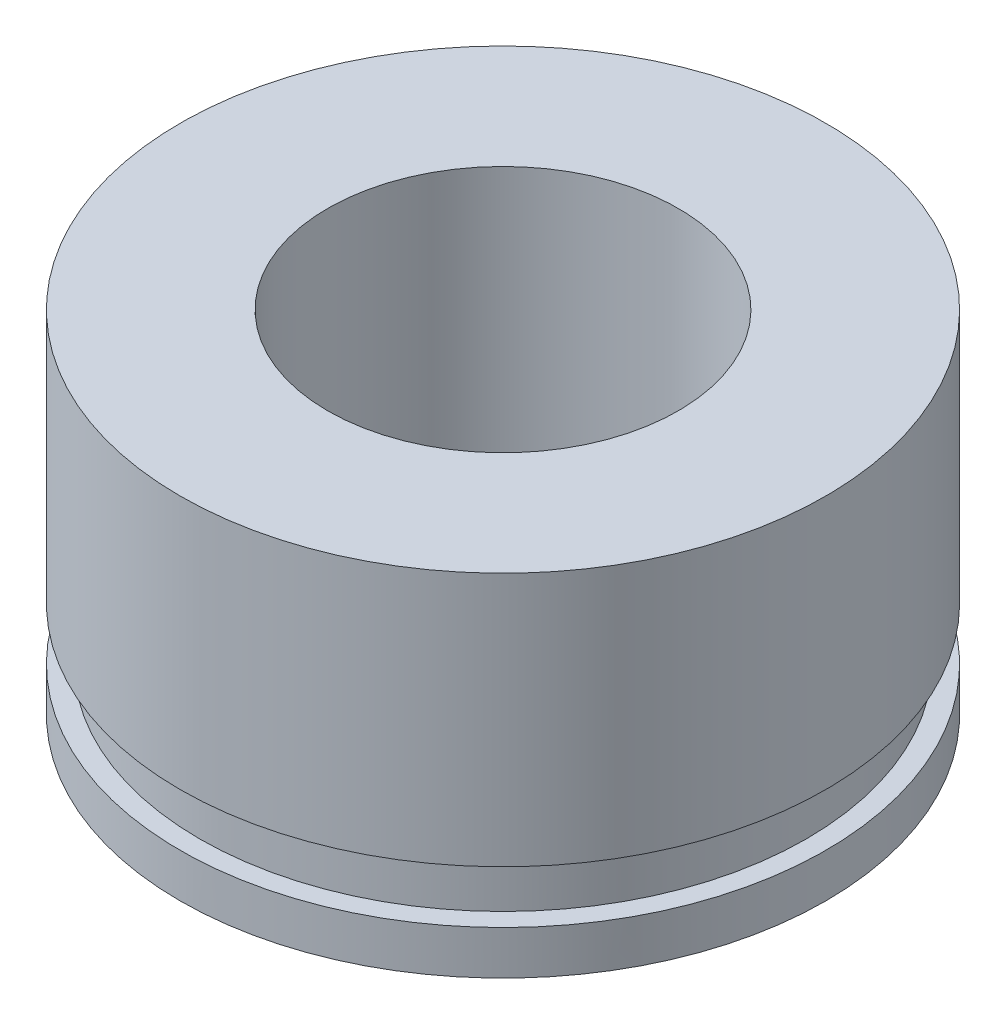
ISO-10303-21;
HEADER;
FILE_DESCRIPTION(('STEP AP214'),'2;1');
FILE_NAME('part.step','',(''),(''),'','','');
FILE_SCHEMA(('AUTOMOTIVE_DESIGN { 1 0 10303 214 1 1 1 1 }'));
ENDSEC;
DATA;
#1=APPLICATION_CONTEXT('core data for automotive mechanical design processes');
#2=APPLICATION_PROTOCOL_DEFINITION('international standard','automotive_design',2000,#1);
#3=PRODUCT_CONTEXT('',#1,'mechanical');
#4=PRODUCT('Part','Part','',(#3));
#5=PRODUCT_RELATED_PRODUCT_CATEGORY('part','',(#4));
#6=PRODUCT_DEFINITION_FORMATION('','',#4);
#7=PRODUCT_DEFINITION_CONTEXT('part definition',#1,'design');
#8=PRODUCT_DEFINITION('design','',#6,#7);
#9=PRODUCT_DEFINITION_SHAPE('','',#8);
#10=(LENGTH_UNIT() NAMED_UNIT(*) SI_UNIT(.MILLI.,.METRE.));
#11=(NAMED_UNIT(*) PLANE_ANGLE_UNIT() SI_UNIT($,.RADIAN.));
#12=(NAMED_UNIT(*) SI_UNIT($,.STERADIAN.) SOLID_ANGLE_UNIT());
#13=UNCERTAINTY_MEASURE_WITH_UNIT(LENGTH_MEASURE(1.E-05),#10,'distance_accuracy_value','');
#14=(GEOMETRIC_REPRESENTATION_CONTEXT(3) GLOBAL_UNCERTAINTY_ASSIGNED_CONTEXT((#13)) GLOBAL_UNIT_ASSIGNED_CONTEXT((#10,
#11,#12)) REPRESENTATION_CONTEXT('',''));
#15=CARTESIAN_POINT('',(0.,0.,0.));
#16=DIRECTION('',(0.,0.,1.));
#17=DIRECTION('',(1.,0.,0.));
#18=AXIS2_PLACEMENT_3D('',#15,#16,#17);
#19=CARTESIAN_POINT('',(0.,20.,0.));
#20=DIRECTION('',(0.,-1.,0.));
#21=DIRECTION('',(0.,0.,-1.));
#22=AXIS2_PLACEMENT_3D('',#19,#20,#21);
#23=CYLINDRICAL_SURFACE('',#22,18.415);
#24=CARTESIAN_POINT('',(0.,2.5,0.));
#25=DIRECTION('',(0.,-1.,0.));
#26=DIRECTION('',(0.,0.,-1.));
#27=AXIS2_PLACEMENT_3D('',#24,#25,#26);
#28=CIRCLE('',#27,18.415);
#29=CARTESIAN_POINT('',(0.,2.5,-18.415));
#30=VERTEX_POINT('',#29);
#31=EDGE_CURVE('E35',#30,#30,#28,.T.);
#32=ORIENTED_EDGE('',*,*,#31,.T.);
#33=EDGE_LOOP('',(#32));
#34=FACE_BOUND('',#33,.T.);
#35=CARTESIAN_POINT('',(0.,0.,0.));
#36=DIRECTION('',(0.,1.,0.));
#37=DIRECTION('',(0.,0.,1.));
#38=AXIS2_PLACEMENT_3D('',#35,#36,#37);
#39=CIRCLE('',#38,18.415);
#40=CARTESIAN_POINT('',(0.,0.,18.415));
#41=VERTEX_POINT('',#40);
#42=EDGE_CURVE('E39',#41,#41,#39,.T.);
#43=ORIENTED_EDGE('',*,*,#42,.T.);
#44=EDGE_LOOP('',(#43));
#45=FACE_BOUND('',#44,.T.);
#46=ADVANCED_FACE('F31',(#34,#45),#23,.T.);
#47=CARTESIAN_POINT('',(0.,5.5,0.));
#48=DIRECTION('',(0.,1.,0.));
#49=DIRECTION('',(0.,0.,1.));
#50=AXIS2_PLACEMENT_3D('',#47,#48,#49);
#51=CIRCLE('',#50,18.415);
#52=CARTESIAN_POINT('',(0.,5.5,18.415));
#53=VERTEX_POINT('',#52);
#54=EDGE_CURVE('E47',#53,#53,#51,.T.);
#55=ORIENTED_EDGE('',*,*,#54,.T.);
#56=EDGE_LOOP('',(#55));
#57=FACE_BOUND('',#56,.T.);
#58=CARTESIAN_POINT('',(0.,20.,0.));
#59=DIRECTION('',(0.,1.,0.));
#60=DIRECTION('',(0.,0.,1.));
#61=AXIS2_PLACEMENT_3D('',#58,#59,#60);
#62=CIRCLE('',#61,18.415);
#63=CARTESIAN_POINT('',(0.,20.,18.415));
#64=VERTEX_POINT('',#63);
#65=EDGE_CURVE('E10',#64,#64,#62,.T.);
#66=ORIENTED_EDGE('',*,*,#65,.F.);
#67=EDGE_LOOP('',(#66));
#68=FACE_BOUND('',#67,.T.);
#69=ADVANCED_FACE('F33',(#57,#68),#23,.T.);
#70=CARTESIAN_POINT('',(0.,20.,0.));
#71=DIRECTION('',(0.,1.,0.));
#72=DIRECTION('',(0.,0.,1.));
#73=AXIS2_PLACEMENT_3D('',#70,#71,#72);
#74=PLANE('',#73);
#75=CARTESIAN_POINT('',(0.,20.,0.));
#76=DIRECTION('',(0.,1.,0.));
#77=DIRECTION('',(0.,0.,1.));
#78=AXIS2_PLACEMENT_3D('',#75,#76,#77);
#79=CIRCLE('',#78,10.);
#80=CARTESIAN_POINT('',(0.,20.,10.));
#81=VERTEX_POINT('',#80);
#82=EDGE_CURVE('E53',#81,#81,#79,.T.);
#83=ORIENTED_EDGE('',*,*,#82,.F.);
#84=EDGE_LOOP('',(#83));
#85=FACE_BOUND('',#84,.T.);
#86=ORIENTED_EDGE('',*,*,#65,.T.);
#87=EDGE_LOOP('',(#86));
#88=FACE_BOUND('',#87,.T.);
#89=ADVANCED_FACE('F76',(#85,#88),#74,.T.);
#90=CARTESIAN_POINT('',(0.,0.,0.));
#91=DIRECTION('',(0.,1.,0.));
#92=DIRECTION('',(0.,0.,1.));
#93=AXIS2_PLACEMENT_3D('',#90,#91,#92);
#94=PLANE('',#93);
#95=CARTESIAN_POINT('',(0.,0.,0.));
#96=DIRECTION('',(0.,1.,0.));
#97=DIRECTION('',(0.,0.,1.));
#98=AXIS2_PLACEMENT_3D('',#95,#96,#97);
#99=CIRCLE('',#98,10.);
#100=CARTESIAN_POINT('',(0.,0.,10.));
#101=VERTEX_POINT('',#100);
#102=EDGE_CURVE('E44',#101,#101,#99,.T.);
#103=ORIENTED_EDGE('',*,*,#102,.T.);
#104=EDGE_LOOP('',(#103));
#105=FACE_BOUND('',#104,.T.);
#106=ORIENTED_EDGE('',*,*,#42,.F.);
#107=EDGE_LOOP('',(#106));
#108=FACE_BOUND('',#107,.T.);
#109=ADVANCED_FACE('F66',(#105,#108),#94,.F.);
#110=CARTESIAN_POINT('',(0.,0.,0.));
#111=DIRECTION('',(0.,1.,0.));
#112=DIRECTION('',(0.,0.,1.));
#113=AXIS2_PLACEMENT_3D('',#110,#111,#112);
#114=CYLINDRICAL_SURFACE('',#113,10.);
#115=ORIENTED_EDGE('',*,*,#102,.F.);
#116=EDGE_LOOP('',(#115));
#117=FACE_BOUND('',#116,.T.);
#118=ORIENTED_EDGE('',*,*,#82,.T.);
#119=EDGE_LOOP('',(#118));
#120=FACE_BOUND('',#119,.T.);
#121=ADVANCED_FACE('F69',(#117,#120),#114,.F.);
#122=CARTESIAN_POINT('',(0.,2.5,-19.0943305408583));
#123=DIRECTION('',(0.,-1.,0.));
#124=DIRECTION('',(0.,0.,-1.));
#125=AXIS2_PLACEMENT_3D('',#122,#123,#124);
#126=PLANE('',#125);
#127=CARTESIAN_POINT('',(0.,2.5,0.));
#128=DIRECTION('',(0.,-1.,0.));
#129=DIRECTION('',(0.,0.,-1.));
#130=AXIS2_PLACEMENT_3D('',#127,#128,#129);
#131=CIRCLE('',#130,17.2957408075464);
#132=CARTESIAN_POINT('',(0.,2.5,-17.2957408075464));
#133=VERTEX_POINT('',#132);
#134=EDGE_CURVE('E49',#133,#133,#131,.T.);
#135=ORIENTED_EDGE('',*,*,#134,.T.);
#136=EDGE_LOOP('',(#135));
#137=FACE_BOUND('',#136,.T.);
#138=ORIENTED_EDGE('',*,*,#31,.F.);
#139=EDGE_LOOP('',(#138));
#140=FACE_BOUND('',#139,.T.);
#141=ADVANCED_FACE('F72',(#137,#140),#126,.F.);
#142=CARTESIAN_POINT('',(0.,5.5,-19.0943305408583));
#143=DIRECTION('',(0.,1.,0.));
#144=DIRECTION('',(0.,0.,1.));
#145=AXIS2_PLACEMENT_3D('',#142,#143,#144);
#146=PLANE('',#145);
#147=CARTESIAN_POINT('',(0.,5.5,0.));
#148=DIRECTION('',(0.,-1.,0.));
#149=DIRECTION('',(0.,0.,-1.));
#150=AXIS2_PLACEMENT_3D('',#147,#148,#149);
#151=CIRCLE('',#150,17.2957408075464);
#152=CARTESIAN_POINT('',(0.,5.5,-17.2957408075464));
#153=VERTEX_POINT('',#152);
#154=EDGE_CURVE('E55',#153,#153,#151,.T.);
#155=ORIENTED_EDGE('',*,*,#154,.F.);
#156=EDGE_LOOP('',(#155));
#157=FACE_BOUND('',#156,.T.);
#158=ORIENTED_EDGE('',*,*,#54,.F.);
#159=EDGE_LOOP('',(#158));
#160=FACE_BOUND('',#159,.T.);
#161=ADVANCED_FACE('F92',(#157,#160),#146,.F.);
#162=CARTESIAN_POINT('',(0.,0.,0.));
#163=DIRECTION('',(0.,-1.,0.));
#164=DIRECTION('',(0.,0.,-1.));
#165=AXIS2_PLACEMENT_3D('',#162,#163,#164);
#166=CYLINDRICAL_SURFACE('',#165,17.2957408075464);
#167=ORIENTED_EDGE('',*,*,#134,.F.);
#168=EDGE_LOOP('',(#167));
#169=FACE_BOUND('',#168,.T.);
#170=ORIENTED_EDGE('',*,*,#154,.T.);
#171=EDGE_LOOP('',(#170));
#172=FACE_BOUND('',#171,.T.);
#173=ADVANCED_FACE('F97',(#169,#172),#166,.T.);
#174=CLOSED_SHELL('',(#46,#69,#89,#109,#121,#141,#161,#173));
#175=MANIFOLD_SOLID_BREP('B2',#174);
#176=ADVANCED_BREP_SHAPE_REPRESENTATION('',(#18,#175),#14);
#177=SHAPE_DEFINITION_REPRESENTATION(#9,#176);
ENDSEC;
END-ISO-10303-21;
